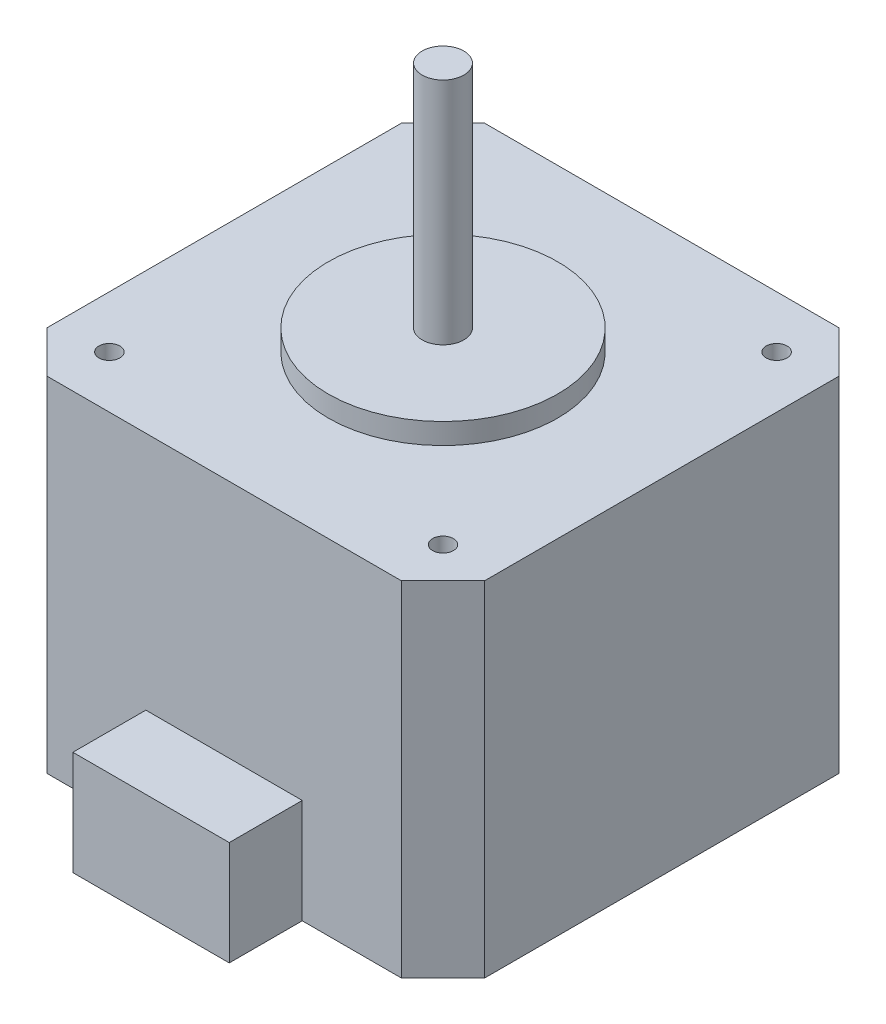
from build123d import *

# Parameters (mm, degrees)
SKETCH1_W                           = 42
SKETCH1_H                           = 42
BOSS_EXTRUDE1_DEPTH                 = 33
SKETCH2_R                           = 11
BOSS_EXTRUDE2_DEPTH                 = 2
SKETCH3_R                           = 2
BOSS_EXTRUDE3_DEPTH                 = 22
SKETCH4_W                           = 15
SKETCH4_H                           = 10
BOSS_EXTRUDE4_DEPTH                 = 7
F_2_0MM_CLEARANCE_DOWEL_HOLE1_D     = 2
F_2_0MM_CLEARANCE_DOWEL_HOLE1_DEPTH = 8
F_2_0MM_CLEARANCE_DOWEL_HOLE1_TIP   = 0.600860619
CHAMFER1_SIZE                       = 4


with BuildPart() as part:
    # Sketch1 → Boss-Extrude1 (new body)
    with BuildSketch(Plane(origin=(0, 0, 0), x_dir=(1, 0, 0), z_dir=(0, 1, 0))):
        with Locations((21, -21)):
            Rectangle(SKETCH1_W, SKETCH1_H)
    extrude(amount=BOSS_EXTRUDE1_DEPTH)

    # Sketch2 → Boss-Extrude2 (add)
    with BuildSketch(Plane(origin=(0, 33, 0), x_dir=(1, 0, 0), z_dir=(0, 1, 0))):
        with Locations(Location((21, -21, 0), (0, 0, 270))):
            Circle(SKETCH2_R)
    extrude(amount=BOSS_EXTRUDE2_DEPTH)

    # Sketch3 → Boss-Extrude3 (add)
    with BuildSketch(Plane(origin=(0, 35, 0), x_dir=(1, 0, 0), z_dir=(0, 1, 0))):
        with Locations(Location((21, -21, 0), (0, 0, 270))):
            Circle(SKETCH3_R)
    extrude(amount=BOSS_EXTRUDE3_DEPTH)

    # Sketch4 → Boss-Extrude4 (add)
    with BuildSketch(Plane.XY.offset(42)):
        with Locations((21, 5)):
            Rectangle(SKETCH4_W, SKETCH4_H)
    extrude(amount=BOSS_EXTRUDE4_DEPTH)

    # 2.0mm Clearance Dowel Hole1
    with Locations(Plane(origin=(37, 33, 5), x_dir=(0, 0, 1), z_dir=(0, 1, 0))):
        with Locations((0, 0), (32, 0), (32, -32), (0, -32)):
            Hole(F_2_0MM_CLEARANCE_DOWEL_HOLE1_D / 2, depth=F_2_0MM_CLEARANCE_DOWEL_HOLE1_DEPTH)
            with Locations((0, 0, -(F_2_0MM_CLEARANCE_DOWEL_HOLE1_DEPTH + F_2_0MM_CLEARANCE_DOWEL_HOLE1_TIP / 2))):  # 118° drill point
                Cone(0, F_2_0MM_CLEARANCE_DOWEL_HOLE1_D / 2, F_2_0MM_CLEARANCE_DOWEL_HOLE1_TIP, mode=Mode.SUBTRACT)

    # Chamfer1
    chamfer1_edges = [part.edges().sort_by_distance(p)[0] for p in [
        (0, 16.5, 0),
        (42, 16.5, 0),
        (42, 16.5, 42),
        (0, 16.5, 42),
    ]]
    chamfer(chamfer1_edges, length=CHAMFER1_SIZE)


solid = part.part
